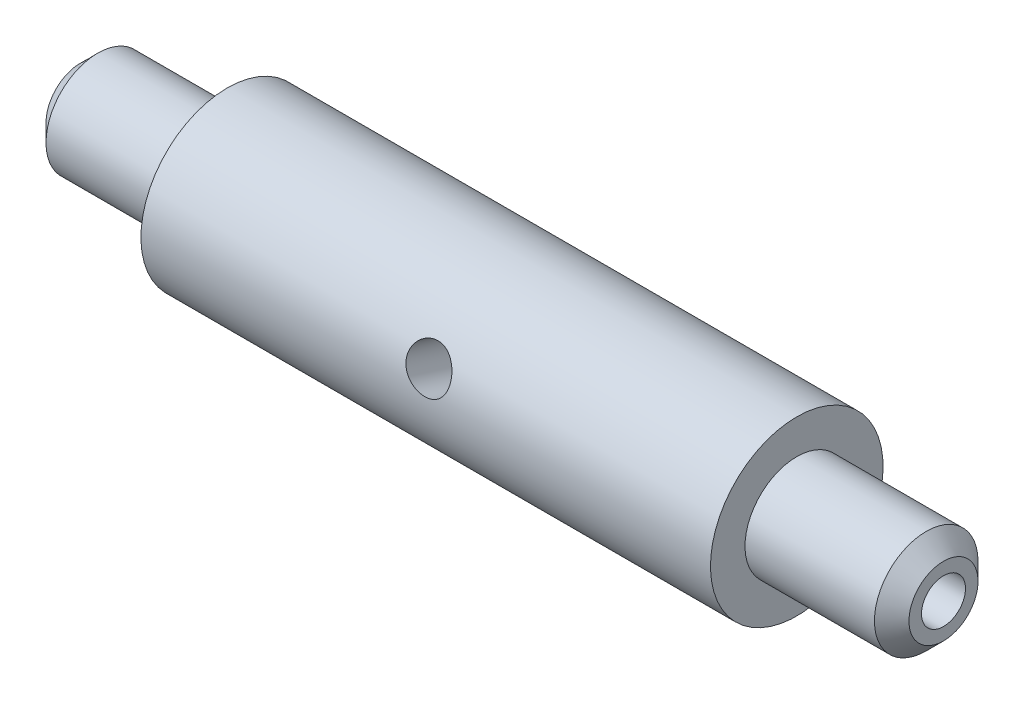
from build123d import *

# Parameters (mm, degrees)
SKETCH1_W                 = 66
SKETCH1_H                 = 10
SKETCH1_W_2               = 17
SKETCH1_H_2               = 6
CHAMFER1_SIZE             = 2
CHAMFER2_SIZE             = 2
F_5_0MM_DOWEL_HOLE3_D     = 5.1
F_5_0MM_DOWEL_HOLE3_DEPTH = 48.467805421
F_5_0MM_DOWEL_HOLE3_TIP   = 1.532194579
F_5_0MM_DOWEL_HOLE4_D     = 5.1
F_5_0MM_DOWEL_HOLE4_DEPTH = 12.467805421
F_5_0MM_DOWEL_HOLE4_TIP   = 1.532194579


with BuildPart() as part:
    # Sketch1 → Revolve5 (revolve)
    with BuildSketch(Plane.XY):
        with Locations((-9.732226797, 5)):
            Rectangle(SKETCH1_W, SKETCH1_H)
        with Locations((-51.232226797, 3)):
            Rectangle(SKETCH1_W_2, SKETCH1_H_2)
        with Locations((31.767773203, 3)):
            Rectangle(SKETCH1_W_2, SKETCH1_H_2)
    revolve(axis=Axis((0, 0, 0), (-1, 0, 0)))

    # Chamfer1
    chamfer1_edges = [part.edges().sort_by_distance(p)[0] for p in [
        (-59.732226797, -6, 0),
    ]]
    chamfer(chamfer1_edges, length=CHAMFER1_SIZE)

    # Chamfer2
    chamfer2_edges = [part.edges().sort_by_distance(p)[0] for p in [
        (40.267773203, -6, 0),
    ]]
    chamfer(chamfer2_edges, length=CHAMFER2_SIZE)

    # 5.0mm Dowel Hole3
    with Locations(Plane.YZ.offset(40.267773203)):
        with Locations((0, 0)):
            Hole(F_5_0MM_DOWEL_HOLE3_D / 2, depth=F_5_0MM_DOWEL_HOLE3_DEPTH)
            with Locations((0, 0, -(F_5_0MM_DOWEL_HOLE3_DEPTH + F_5_0MM_DOWEL_HOLE3_TIP / 2))):  # 118° drill point
                Cone(0, F_5_0MM_DOWEL_HOLE3_D / 2, F_5_0MM_DOWEL_HOLE3_TIP, mode=Mode.SUBTRACT)

    # 5.0mm Dowel Hole4
    with Locations(Plane(origin=(-9.843174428, 2.986323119, 9.543682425), x_dir=(0, 0.954368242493, -0.298632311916), z_dir=(0, 0.298632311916, 0.954368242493))):
        with Locations((0, 0)):
            Hole(F_5_0MM_DOWEL_HOLE4_D / 2, depth=F_5_0MM_DOWEL_HOLE4_DEPTH)
            with Locations((0, 0, -(F_5_0MM_DOWEL_HOLE4_DEPTH + F_5_0MM_DOWEL_HOLE4_TIP / 2))):  # 118° drill point
                Cone(0, F_5_0MM_DOWEL_HOLE4_D / 2, F_5_0MM_DOWEL_HOLE4_TIP, mode=Mode.SUBTRACT)


solid = part.part
